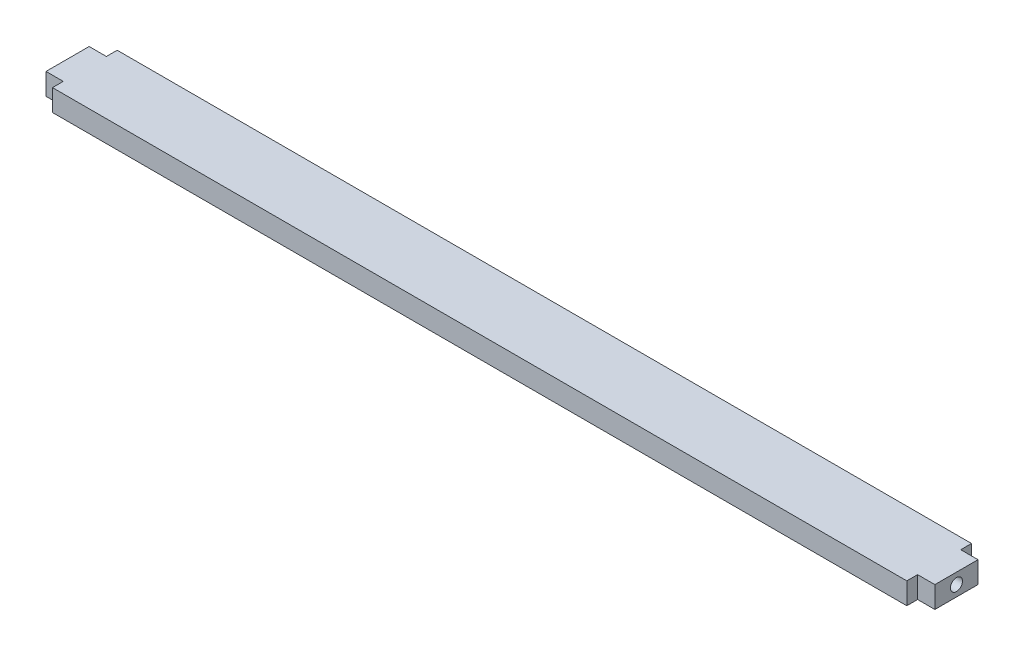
ISO-10303-21;
HEADER;
FILE_DESCRIPTION(('STEP AP214'),'2;1');
FILE_NAME('part.step','',(''),(''),'','','');
FILE_SCHEMA(('AUTOMOTIVE_DESIGN { 1 0 10303 214 1 1 1 1 }'));
ENDSEC;
DATA;
#1=APPLICATION_CONTEXT('core data for automotive mechanical design processes');
#2=APPLICATION_PROTOCOL_DEFINITION('international standard','automotive_design',2000,#1);
#3=PRODUCT_CONTEXT('',#1,'mechanical');
#4=PRODUCT('Part','Part','',(#3));
#5=PRODUCT_RELATED_PRODUCT_CATEGORY('part','',(#4));
#6=PRODUCT_DEFINITION_FORMATION('','',#4);
#7=PRODUCT_DEFINITION_CONTEXT('part definition',#1,'design');
#8=PRODUCT_DEFINITION('design','',#6,#7);
#9=PRODUCT_DEFINITION_SHAPE('','',#8);
#10=(LENGTH_UNIT() NAMED_UNIT(*) SI_UNIT(.MILLI.,.METRE.));
#11=(NAMED_UNIT(*) PLANE_ANGLE_UNIT() SI_UNIT($,.RADIAN.));
#12=(NAMED_UNIT(*) SI_UNIT($,.STERADIAN.) SOLID_ANGLE_UNIT());
#13=UNCERTAINTY_MEASURE_WITH_UNIT(LENGTH_MEASURE(1.E-05),#10,'distance_accuracy_value','');
#14=(GEOMETRIC_REPRESENTATION_CONTEXT(3) GLOBAL_UNCERTAINTY_ASSIGNED_CONTEXT((#13)) GLOBAL_UNIT_ASSIGNED_CONTEXT((#10,
#11,#12)) REPRESENTATION_CONTEXT('',''));
#15=CARTESIAN_POINT('',(0.,0.,0.));
#16=DIRECTION('',(0.,0.,1.));
#17=DIRECTION('',(1.,0.,0.));
#18=AXIS2_PLACEMENT_3D('',#15,#16,#17);
#19=CARTESIAN_POINT('',(-99.,5.,7.5));
#20=DIRECTION('',(-1.,0.,0.));
#21=DIRECTION('',(0.,0.,1.));
#22=AXIS2_PLACEMENT_3D('',#19,#20,#21);
#23=PLANE('',#22);
#24=DIRECTION('',(0.,0.,-1.));
#25=VECTOR('',#24,1.);
#26=CARTESIAN_POINT('',(-99.,0.,7.5));
#27=LINE('',#26,#25);
#28=CARTESIAN_POINT('',(-99.,0.,7.5));
#29=VERTEX_POINT('',#28);
#30=CARTESIAN_POINT('',(-99.,0.,5.));
#31=VERTEX_POINT('',#30);
#32=EDGE_CURVE('E161',#29,#31,#27,.T.);
#33=ORIENTED_EDGE('',*,*,#32,.F.);
#34=DIRECTION('',(0.,-1.,0.));
#35=VECTOR('',#34,1.);
#36=CARTESIAN_POINT('',(-99.,5.,7.5));
#37=LINE('',#36,#35);
#38=CARTESIAN_POINT('',(-99.,5.,7.5));
#39=VERTEX_POINT('',#38);
#40=EDGE_CURVE('E11',#39,#29,#37,.T.);
#41=ORIENTED_EDGE('',*,*,#40,.F.);
#42=DIRECTION('',(0.,0.,-1.));
#43=VECTOR('',#42,1.);
#44=CARTESIAN_POINT('',(-99.,5.,7.5));
#45=LINE('',#44,#43);
#46=CARTESIAN_POINT('',(-99.,5.,5.));
#47=VERTEX_POINT('',#46);
#48=EDGE_CURVE('E191',#39,#47,#45,.T.);
#49=ORIENTED_EDGE('',*,*,#48,.T.);
#50=DIRECTION('',(0.,-1.,0.));
#51=VECTOR('',#50,1.);
#52=CARTESIAN_POINT('',(-99.,5.,5.));
#53=LINE('',#52,#51);
#54=EDGE_CURVE('E42',#47,#31,#53,.T.);
#55=ORIENTED_EDGE('',*,*,#54,.T.);
#56=EDGE_LOOP('',(#33,#41,#49,#55));
#57=FACE_BOUND('',#56,.T.);
#58=ADVANCED_FACE('F39',(#57),#23,.T.);
#59=CARTESIAN_POINT('',(-99.,5.,7.5));
#60=DIRECTION('',(0.,0.,-1.));
#61=DIRECTION('',(-1.,0.,0.));
#62=AXIS2_PLACEMENT_3D('',#59,#60,#61);
#63=PLANE('',#62);
#64=DIRECTION('',(1.,0.,0.));
#65=VECTOR('',#64,1.);
#66=CARTESIAN_POINT('',(-99.,0.,7.5));
#67=LINE('',#66,#65);
#68=CARTESIAN_POINT('',(99.,0.,7.50000000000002));
#69=VERTEX_POINT('',#68);
#70=EDGE_CURVE('E96',#29,#69,#67,.T.);
#71=ORIENTED_EDGE('',*,*,#70,.T.);
#72=DIRECTION('',(0.,-1.,0.));
#73=VECTOR('',#72,1.);
#74=CARTESIAN_POINT('',(99.,5.,7.50000000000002));
#75=LINE('',#74,#73);
#76=CARTESIAN_POINT('',(99.,5.,7.50000000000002));
#77=VERTEX_POINT('',#76);
#78=EDGE_CURVE('E48',#77,#69,#75,.T.);
#79=ORIENTED_EDGE('',*,*,#78,.F.);
#80=DIRECTION('',(1.,0.,0.));
#81=VECTOR('',#80,1.);
#82=CARTESIAN_POINT('',(-99.,5.,7.5));
#83=LINE('',#82,#81);
#84=EDGE_CURVE('E140',#39,#77,#83,.T.);
#85=ORIENTED_EDGE('',*,*,#84,.F.);
#86=ORIENTED_EDGE('',*,*,#40,.T.);
#87=EDGE_LOOP('',(#71,#79,#85,#86));
#88=FACE_BOUND('',#87,.T.);
#89=ADVANCED_FACE('F272',(#88),#63,.F.);
#90=CARTESIAN_POINT('',(99.,5.,7.50000000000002));
#91=DIRECTION('',(-1.,0.,0.));
#92=DIRECTION('',(0.,0.,1.));
#93=AXIS2_PLACEMENT_3D('',#90,#91,#92);
#94=PLANE('',#93);
#95=DIRECTION('',(0.,0.,-1.));
#96=VECTOR('',#95,1.);
#97=CARTESIAN_POINT('',(99.,0.,7.50000000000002));
#98=LINE('',#97,#96);
#99=CARTESIAN_POINT('',(99.,0.,5.00000000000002));
#100=VERTEX_POINT('',#99);
#101=EDGE_CURVE('E147',#69,#100,#98,.T.);
#102=ORIENTED_EDGE('',*,*,#101,.T.);
#103=DIRECTION('',(0.,-1.,0.));
#104=VECTOR('',#103,1.);
#105=CARTESIAN_POINT('',(99.,5.,5.00000000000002));
#106=LINE('',#105,#104);
#107=CARTESIAN_POINT('',(99.,5.,5.00000000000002));
#108=VERTEX_POINT('',#107);
#109=EDGE_CURVE('E144',#108,#100,#106,.T.);
#110=ORIENTED_EDGE('',*,*,#109,.F.);
#111=DIRECTION('',(0.,0.,-1.));
#112=VECTOR('',#111,1.);
#113=CARTESIAN_POINT('',(99.,5.,7.50000000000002));
#114=LINE('',#113,#112);
#115=EDGE_CURVE('E133',#77,#108,#114,.T.);
#116=ORIENTED_EDGE('',*,*,#115,.F.);
#117=ORIENTED_EDGE('',*,*,#78,.T.);
#118=EDGE_LOOP('',(#102,#110,#116,#117));
#119=FACE_BOUND('',#118,.T.);
#120=ADVANCED_FACE('F145',(#119),#94,.F.);
#121=CARTESIAN_POINT('',(103.,5.,5.00000000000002));
#122=DIRECTION('',(0.,0.,1.));
#123=DIRECTION('',(1.,0.,0.));
#124=AXIS2_PLACEMENT_3D('',#121,#122,#123);
#125=PLANE('',#124);
#126=DIRECTION('',(-1.,0.,0.));
#127=VECTOR('',#126,1.);
#128=CARTESIAN_POINT('',(103.,0.,5.00000000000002));
#129=LINE('',#128,#127);
#130=CARTESIAN_POINT('',(103.,0.,5.00000000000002));
#131=VERTEX_POINT('',#130);
#132=EDGE_CURVE('E188',#131,#100,#129,.T.);
#133=ORIENTED_EDGE('',*,*,#132,.F.);
#134=DIRECTION('',(0.,-1.,0.));
#135=VECTOR('',#134,1.);
#136=CARTESIAN_POINT('',(103.,5.,5.00000000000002));
#137=LINE('',#136,#135);
#138=CARTESIAN_POINT('',(103.,5.,5.00000000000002));
#139=VERTEX_POINT('',#138);
#140=EDGE_CURVE('E151',#139,#131,#137,.T.);
#141=ORIENTED_EDGE('',*,*,#140,.F.);
#142=DIRECTION('',(-1.,0.,0.));
#143=VECTOR('',#142,1.);
#144=CARTESIAN_POINT('',(103.,5.,5.00000000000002));
#145=LINE('',#144,#143);
#146=EDGE_CURVE('E138',#139,#108,#145,.T.);
#147=ORIENTED_EDGE('',*,*,#146,.T.);
#148=ORIENTED_EDGE('',*,*,#109,.T.);
#149=EDGE_LOOP('',(#133,#141,#147,#148));
#150=FACE_BOUND('',#149,.T.);
#151=ADVANCED_FACE('F153',(#150),#125,.T.);
#152=CARTESIAN_POINT('',(103.,5.,-5.00000000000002));
#153=DIRECTION('',(1.,0.,0.));
#154=DIRECTION('',(0.,0.,-1.));
#155=AXIS2_PLACEMENT_3D('',#152,#153,#154);
#156=PLANE('',#155);
#157=CARTESIAN_POINT('',(103.,2.5,0.));
#158=DIRECTION('',(1.,0.,0.));
#159=DIRECTION('',(0.,0.,-1.));
#160=AXIS2_PLACEMENT_3D('',#157,#158,#159);
#161=CIRCLE('',#160,1.4);
#162=CARTESIAN_POINT('',(103.,2.5,-1.4));
#163=VERTEX_POINT('',#162);
#164=EDGE_CURVE('E165',#163,#163,#161,.T.);
#165=ORIENTED_EDGE('',*,*,#164,.F.);
#166=EDGE_LOOP('',(#165));
#167=FACE_BOUND('',#166,.T.);
#168=DIRECTION('',(0.,0.,1.));
#169=VECTOR('',#168,1.);
#170=CARTESIAN_POINT('',(103.,0.,-5.00000000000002));
#171=LINE('',#170,#169);
#172=CARTESIAN_POINT('',(103.,0.,-5.00000000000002));
#173=VERTEX_POINT('',#172);
#174=EDGE_CURVE('E185',#173,#131,#171,.T.);
#175=ORIENTED_EDGE('',*,*,#174,.F.);
#176=DIRECTION('',(0.,-1.,0.));
#177=VECTOR('',#176,1.);
#178=CARTESIAN_POINT('',(103.,5.,-5.00000000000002));
#179=LINE('',#178,#177);
#180=CARTESIAN_POINT('',(103.,5.,-5.00000000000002));
#181=VERTEX_POINT('',#180);
#182=EDGE_CURVE('E195',#181,#173,#179,.T.);
#183=ORIENTED_EDGE('',*,*,#182,.F.);
#184=DIRECTION('',(0.,0.,1.));
#185=VECTOR('',#184,1.);
#186=CARTESIAN_POINT('',(103.,5.,-5.00000000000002));
#187=LINE('',#186,#185);
#188=EDGE_CURVE('E154',#181,#139,#187,.T.);
#189=ORIENTED_EDGE('',*,*,#188,.T.);
#190=ORIENTED_EDGE('',*,*,#140,.T.);
#191=EDGE_LOOP('',(#175,#183,#189,#190));
#192=FACE_BOUND('',#191,.T.);
#193=ADVANCED_FACE('F218',(#167,#192),#156,.T.);
#194=CARTESIAN_POINT('',(103.,5.,-5.00000000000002));
#195=DIRECTION('',(0.,0.,1.));
#196=DIRECTION('',(1.,0.,0.));
#197=AXIS2_PLACEMENT_3D('',#194,#195,#196);
#198=PLANE('',#197);
#199=DIRECTION('',(-1.,0.,0.));
#200=VECTOR('',#199,1.);
#201=CARTESIAN_POINT('',(103.,0.,-5.00000000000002));
#202=LINE('',#201,#200);
#203=CARTESIAN_POINT('',(99.,0.,-5.00000000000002));
#204=VERTEX_POINT('',#203);
#205=EDGE_CURVE('E182',#173,#204,#202,.T.);
#206=ORIENTED_EDGE('',*,*,#205,.T.);
#207=DIRECTION('',(0.,-1.,0.));
#208=VECTOR('',#207,1.);
#209=CARTESIAN_POINT('',(99.,5.,-5.00000000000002));
#210=LINE('',#209,#208);
#211=CARTESIAN_POINT('',(99.,5.,-5.00000000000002));
#212=VERTEX_POINT('',#211);
#213=EDGE_CURVE('E197',#212,#204,#210,.T.);
#214=ORIENTED_EDGE('',*,*,#213,.F.);
#215=DIRECTION('',(-1.,0.,0.));
#216=VECTOR('',#215,1.);
#217=CARTESIAN_POINT('',(103.,5.,-5.00000000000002));
#218=LINE('',#217,#216);
#219=EDGE_CURVE('E156',#181,#212,#218,.T.);
#220=ORIENTED_EDGE('',*,*,#219,.F.);
#221=ORIENTED_EDGE('',*,*,#182,.T.);
#222=EDGE_LOOP('',(#206,#214,#220,#221));
#223=FACE_BOUND('',#222,.T.);
#224=ADVANCED_FACE('F227',(#223),#198,.F.);
#225=CARTESIAN_POINT('',(99.,5.,-7.50000000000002));
#226=DIRECTION('',(1.,0.,0.));
#227=DIRECTION('',(0.,0.,-1.));
#228=AXIS2_PLACEMENT_3D('',#225,#226,#227);
#229=PLANE('',#228);
#230=DIRECTION('',(0.,0.,1.));
#231=VECTOR('',#230,1.);
#232=CARTESIAN_POINT('',(99.,0.,-7.50000000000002));
#233=LINE('',#232,#231);
#234=CARTESIAN_POINT('',(99.,0.,-7.50000000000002));
#235=VERTEX_POINT('',#234);
#236=EDGE_CURVE('E179',#235,#204,#233,.T.);
#237=ORIENTED_EDGE('',*,*,#236,.F.);
#238=DIRECTION('',(0.,-1.,0.));
#239=VECTOR('',#238,1.);
#240=CARTESIAN_POINT('',(99.,5.,-7.50000000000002));
#241=LINE('',#240,#239);
#242=CARTESIAN_POINT('',(99.,5.,-7.50000000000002));
#243=VERTEX_POINT('',#242);
#244=EDGE_CURVE('E199',#243,#235,#241,.T.);
#245=ORIENTED_EDGE('',*,*,#244,.F.);
#246=DIRECTION('',(0.,0.,1.));
#247=VECTOR('',#246,1.);
#248=CARTESIAN_POINT('',(99.,5.,-7.50000000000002));
#249=LINE('',#248,#247);
#250=EDGE_CURVE('E224',#243,#212,#249,.T.);
#251=ORIENTED_EDGE('',*,*,#250,.T.);
#252=ORIENTED_EDGE('',*,*,#213,.T.);
#253=EDGE_LOOP('',(#237,#245,#251,#252));
#254=FACE_BOUND('',#253,.T.);
#255=ADVANCED_FACE('F230',(#254),#229,.T.);
#256=CARTESIAN_POINT('',(-99.,5.,-7.5));
#257=DIRECTION('',(0.,0.,-1.));
#258=DIRECTION('',(-1.,0.,0.));
#259=AXIS2_PLACEMENT_3D('',#256,#257,#258);
#260=PLANE('',#259);
#261=DIRECTION('',(1.,0.,0.));
#262=VECTOR('',#261,1.);
#263=CARTESIAN_POINT('',(-99.,0.,-7.5));
#264=LINE('',#263,#262);
#265=CARTESIAN_POINT('',(-99.,0.,-7.5));
#266=VERTEX_POINT('',#265);
#267=EDGE_CURVE('E176',#266,#235,#264,.T.);
#268=ORIENTED_EDGE('',*,*,#267,.F.);
#269=DIRECTION('',(0.,-1.,0.));
#270=VECTOR('',#269,1.);
#271=CARTESIAN_POINT('',(-99.,5.,-7.5));
#272=LINE('',#271,#270);
#273=CARTESIAN_POINT('',(-99.,5.,-7.5));
#274=VERTEX_POINT('',#273);
#275=EDGE_CURVE('E201',#274,#266,#272,.T.);
#276=ORIENTED_EDGE('',*,*,#275,.F.);
#277=DIRECTION('',(1.,0.,0.));
#278=VECTOR('',#277,1.);
#279=CARTESIAN_POINT('',(-99.,5.,-7.5));
#280=LINE('',#279,#278);
#281=EDGE_CURVE('E231',#274,#243,#280,.T.);
#282=ORIENTED_EDGE('',*,*,#281,.T.);
#283=ORIENTED_EDGE('',*,*,#244,.T.);
#284=EDGE_LOOP('',(#268,#276,#282,#283));
#285=FACE_BOUND('',#284,.T.);
#286=ADVANCED_FACE('F293',(#285),#260,.T.);
#287=CARTESIAN_POINT('',(-99.,5.,-7.5));
#288=DIRECTION('',(1.,0.,0.));
#289=DIRECTION('',(0.,0.,-1.));
#290=AXIS2_PLACEMENT_3D('',#287,#288,#289);
#291=PLANE('',#290);
#292=DIRECTION('',(0.,0.,1.));
#293=VECTOR('',#292,1.);
#294=CARTESIAN_POINT('',(-99.,0.,-7.5));
#295=LINE('',#294,#293);
#296=CARTESIAN_POINT('',(-99.,0.,-5.));
#297=VERTEX_POINT('',#296);
#298=EDGE_CURVE('E173',#266,#297,#295,.T.);
#299=ORIENTED_EDGE('',*,*,#298,.T.);
#300=DIRECTION('',(0.,-1.,0.));
#301=VECTOR('',#300,1.);
#302=CARTESIAN_POINT('',(-99.,5.,-5.));
#303=LINE('',#302,#301);
#304=CARTESIAN_POINT('',(-99.,5.,-5.));
#305=VERTEX_POINT('',#304);
#306=EDGE_CURVE('E203',#305,#297,#303,.T.);
#307=ORIENTED_EDGE('',*,*,#306,.F.);
#308=DIRECTION('',(0.,0.,1.));
#309=VECTOR('',#308,1.);
#310=CARTESIAN_POINT('',(-99.,5.,-7.5));
#311=LINE('',#310,#309);
#312=EDGE_CURVE('E233',#274,#305,#311,.T.);
#313=ORIENTED_EDGE('',*,*,#312,.F.);
#314=ORIENTED_EDGE('',*,*,#275,.T.);
#315=EDGE_LOOP('',(#299,#307,#313,#314));
#316=FACE_BOUND('',#315,.T.);
#317=ADVANCED_FACE('F296',(#316),#291,.F.);
#318=CARTESIAN_POINT('',(-103.,5.,-5.));
#319=DIRECTION('',(0.,0.,-1.));
#320=DIRECTION('',(-1.,0.,0.));
#321=AXIS2_PLACEMENT_3D('',#318,#319,#320);
#322=PLANE('',#321);
#323=DIRECTION('',(1.,0.,0.));
#324=VECTOR('',#323,1.);
#325=CARTESIAN_POINT('',(-103.,0.,-5.));
#326=LINE('',#325,#324);
#327=CARTESIAN_POINT('',(-103.,0.,-5.));
#328=VERTEX_POINT('',#327);
#329=EDGE_CURVE('E170',#328,#297,#326,.T.);
#330=ORIENTED_EDGE('',*,*,#329,.F.);
#331=DIRECTION('',(0.,-1.,0.));
#332=VECTOR('',#331,1.);
#333=CARTESIAN_POINT('',(-103.,5.,-5.));
#334=LINE('',#333,#332);
#335=CARTESIAN_POINT('',(-103.,5.,-5.));
#336=VERTEX_POINT('',#335);
#337=EDGE_CURVE('E205',#336,#328,#334,.T.);
#338=ORIENTED_EDGE('',*,*,#337,.F.);
#339=DIRECTION('',(1.,0.,0.));
#340=VECTOR('',#339,1.);
#341=CARTESIAN_POINT('',(-103.,5.,-5.));
#342=LINE('',#341,#340);
#343=EDGE_CURVE('E237',#336,#305,#342,.T.);
#344=ORIENTED_EDGE('',*,*,#343,.T.);
#345=ORIENTED_EDGE('',*,*,#306,.T.);
#346=EDGE_LOOP('',(#330,#338,#344,#345));
#347=FACE_BOUND('',#346,.T.);
#348=ADVANCED_FACE('F300',(#347),#322,.T.);
#349=CARTESIAN_POINT('',(-103.,5.,-5.));
#350=DIRECTION('',(1.,0.,0.));
#351=DIRECTION('',(0.,0.,-1.));
#352=AXIS2_PLACEMENT_3D('',#349,#350,#351);
#353=PLANE('',#352);
#354=CARTESIAN_POINT('',(-103.,2.5,0.));
#355=DIRECTION('',(1.,0.,0.));
#356=DIRECTION('',(0.,0.,-1.));
#357=AXIS2_PLACEMENT_3D('',#354,#355,#356);
#358=CIRCLE('',#357,1.4);
#359=CARTESIAN_POINT('',(-103.,2.5,-1.4));
#360=VERTEX_POINT('',#359);
#361=EDGE_CURVE('E247',#360,#360,#358,.T.);
#362=ORIENTED_EDGE('',*,*,#361,.T.);
#363=EDGE_LOOP('',(#362));
#364=FACE_BOUND('',#363,.T.);
#365=DIRECTION('',(0.,0.,1.));
#366=VECTOR('',#365,1.);
#367=CARTESIAN_POINT('',(-103.,0.,-5.));
#368=LINE('',#367,#366);
#369=CARTESIAN_POINT('',(-103.,0.,5.));
#370=VERTEX_POINT('',#369);
#371=EDGE_CURVE('E168',#328,#370,#368,.T.);
#372=ORIENTED_EDGE('',*,*,#371,.T.);
#373=DIRECTION('',(0.,-1.,0.));
#374=VECTOR('',#373,1.);
#375=CARTESIAN_POINT('',(-103.,5.,5.));
#376=LINE('',#375,#374);
#377=CARTESIAN_POINT('',(-103.,5.,5.));
#378=VERTEX_POINT('',#377);
#379=EDGE_CURVE('E206',#378,#370,#376,.T.);
#380=ORIENTED_EDGE('',*,*,#379,.F.);
#381=DIRECTION('',(0.,0.,1.));
#382=VECTOR('',#381,1.);
#383=CARTESIAN_POINT('',(-103.,5.,-5.));
#384=LINE('',#383,#382);
#385=EDGE_CURVE('E240',#336,#378,#384,.T.);
#386=ORIENTED_EDGE('',*,*,#385,.F.);
#387=ORIENTED_EDGE('',*,*,#337,.T.);
#388=EDGE_LOOP('',(#372,#380,#386,#387));
#389=FACE_BOUND('',#388,.T.);
#390=ADVANCED_FACE('F256',(#364,#389),#353,.F.);
#391=CARTESIAN_POINT('',(-103.,5.,5.));
#392=DIRECTION('',(0.,0.,-1.));
#393=DIRECTION('',(-1.,0.,0.));
#394=AXIS2_PLACEMENT_3D('',#391,#392,#393);
#395=PLANE('',#394);
#396=DIRECTION('',(1.,0.,0.));
#397=VECTOR('',#396,1.);
#398=CARTESIAN_POINT('',(-103.,0.,5.));
#399=LINE('',#398,#397);
#400=EDGE_CURVE('E164',#370,#31,#399,.T.);
#401=ORIENTED_EDGE('',*,*,#400,.T.);
#402=ORIENTED_EDGE('',*,*,#54,.F.);
#403=DIRECTION('',(1.,0.,0.));
#404=VECTOR('',#403,1.);
#405=CARTESIAN_POINT('',(-103.,5.,5.));
#406=LINE('',#405,#404);
#407=EDGE_CURVE('E106',#378,#47,#406,.T.);
#408=ORIENTED_EDGE('',*,*,#407,.F.);
#409=ORIENTED_EDGE('',*,*,#379,.T.);
#410=EDGE_LOOP('',(#401,#402,#408,#409));
#411=FACE_BOUND('',#410,.T.);
#412=ADVANCED_FACE('F211',(#411),#395,.F.);
#413=CARTESIAN_POINT('',(0.,5.,0.));
#414=DIRECTION('',(0.,-1.,0.));
#415=DIRECTION('',(0.,0.,-1.));
#416=AXIS2_PLACEMENT_3D('',#413,#414,#415);
#417=PLANE('',#416);
#418=ORIENTED_EDGE('',*,*,#48,.F.);
#419=ORIENTED_EDGE('',*,*,#84,.T.);
#420=ORIENTED_EDGE('',*,*,#115,.T.);
#421=ORIENTED_EDGE('',*,*,#146,.F.);
#422=ORIENTED_EDGE('',*,*,#188,.F.);
#423=ORIENTED_EDGE('',*,*,#219,.T.);
#424=ORIENTED_EDGE('',*,*,#250,.F.);
#425=ORIENTED_EDGE('',*,*,#281,.F.);
#426=ORIENTED_EDGE('',*,*,#312,.T.);
#427=ORIENTED_EDGE('',*,*,#343,.F.);
#428=ORIENTED_EDGE('',*,*,#385,.T.);
#429=ORIENTED_EDGE('',*,*,#407,.T.);
#430=EDGE_LOOP('',(#418,#419,#420,#421,#422,#423,#424,#425,#426,#427,#428,#429));
#431=FACE_BOUND('',#430,.T.);
#432=ADVANCED_FACE('F135',(#431),#417,.F.);
#433=CARTESIAN_POINT('',(0.,0.,0.));
#434=DIRECTION('',(0.,-1.,0.));
#435=DIRECTION('',(0.,0.,-1.));
#436=AXIS2_PLACEMENT_3D('',#433,#434,#435);
#437=PLANE('',#436);
#438=ORIENTED_EDGE('',*,*,#32,.T.);
#439=ORIENTED_EDGE('',*,*,#400,.F.);
#440=ORIENTED_EDGE('',*,*,#371,.F.);
#441=ORIENTED_EDGE('',*,*,#329,.T.);
#442=ORIENTED_EDGE('',*,*,#298,.F.);
#443=ORIENTED_EDGE('',*,*,#267,.T.);
#444=ORIENTED_EDGE('',*,*,#236,.T.);
#445=ORIENTED_EDGE('',*,*,#205,.F.);
#446=ORIENTED_EDGE('',*,*,#174,.T.);
#447=ORIENTED_EDGE('',*,*,#132,.T.);
#448=ORIENTED_EDGE('',*,*,#101,.F.);
#449=ORIENTED_EDGE('',*,*,#70,.F.);
#450=EDGE_LOOP('',(#438,#439,#440,#441,#442,#443,#444,#445,#446,#447,#448,#449));
#451=FACE_BOUND('',#450,.T.);
#452=ADVANCED_FACE('F214',(#451),#437,.T.);
#453=CARTESIAN_POINT('',(103.,2.5,0.));
#454=DIRECTION('',(-1.,0.,0.));
#455=DIRECTION('',(0.,0.,1.));
#456=AXIS2_PLACEMENT_3D('',#453,#454,#455);
#457=CYLINDRICAL_SURFACE('',#456,1.4);
#458=ORIENTED_EDGE('',*,*,#164,.T.);
#459=EDGE_LOOP('',(#458));
#460=FACE_BOUND('',#459,.T.);
#461=CARTESIAN_POINT('',(93.,2.5,0.));
#462=DIRECTION('',(1.,0.,0.));
#463=DIRECTION('',(0.,0.,-1.));
#464=AXIS2_PLACEMENT_3D('',#461,#462,#463);
#465=CIRCLE('',#464,1.4);
#466=CARTESIAN_POINT('',(93.,2.5,-1.4));
#467=VERTEX_POINT('',#466);
#468=EDGE_CURVE('E244',#467,#467,#465,.T.);
#469=ORIENTED_EDGE('',*,*,#468,.F.);
#470=EDGE_LOOP('',(#469));
#471=FACE_BOUND('',#470,.T.);
#472=ADVANCED_FACE('F313',(#460,#471),#457,.F.);
#473=CARTESIAN_POINT('',(93.,2.5,0.));
#474=DIRECTION('',(1.,0.,0.));
#475=DIRECTION('',(0.,0.,-1.));
#476=AXIS2_PLACEMENT_3D('',#473,#474,#475);
#477=PLANE('',#476);
#478=ORIENTED_EDGE('',*,*,#468,.T.);
#479=EDGE_LOOP('',(#478));
#480=FACE_BOUND('',#479,.T.);
#481=ADVANCED_FACE('F263',(#480),#477,.T.);
#482=CARTESIAN_POINT('',(-103.,2.5,0.));
#483=DIRECTION('',(1.,0.,0.));
#484=DIRECTION('',(0.,0.,-1.));
#485=AXIS2_PLACEMENT_3D('',#482,#483,#484);
#486=CYLINDRICAL_SURFACE('',#485,1.4);
#487=ORIENTED_EDGE('',*,*,#361,.F.);
#488=EDGE_LOOP('',(#487));
#489=FACE_BOUND('',#488,.T.);
#490=CARTESIAN_POINT('',(-93.,2.5,0.));
#491=DIRECTION('',(1.,0.,0.));
#492=DIRECTION('',(0.,0.,-1.));
#493=AXIS2_PLACEMENT_3D('',#490,#491,#492);
#494=CIRCLE('',#493,1.4);
#495=CARTESIAN_POINT('',(-93.,2.5,-1.4));
#496=VERTEX_POINT('',#495);
#497=EDGE_CURVE('E250',#496,#496,#494,.T.);
#498=ORIENTED_EDGE('',*,*,#497,.T.);
#499=EDGE_LOOP('',(#498));
#500=FACE_BOUND('',#499,.T.);
#501=ADVANCED_FACE('F259',(#489,#500),#486,.F.);
#502=CARTESIAN_POINT('',(-93.,2.5,0.));
#503=DIRECTION('',(-1.,0.,0.));
#504=DIRECTION('',(0.,0.,-1.));
#505=AXIS2_PLACEMENT_3D('',#502,#503,#504);
#506=PLANE('',#505);
#507=ORIENTED_EDGE('',*,*,#497,.F.);
#508=EDGE_LOOP('',(#507));
#509=FACE_BOUND('',#508,.T.);
#510=ADVANCED_FACE('F262',(#509),#506,.T.);
#511=CLOSED_SHELL('',(#58,#89,#120,#151,#193,#224,#255,#286,#317,#348,#390,#412,#432,#452,#472,
#481,#501,#510));
#512=MANIFOLD_SOLID_BREP('B2',#511);
#513=ADVANCED_BREP_SHAPE_REPRESENTATION('',(#18,#512),#14);
#514=SHAPE_DEFINITION_REPRESENTATION(#9,#513);
ENDSEC;
END-ISO-10303-21;
